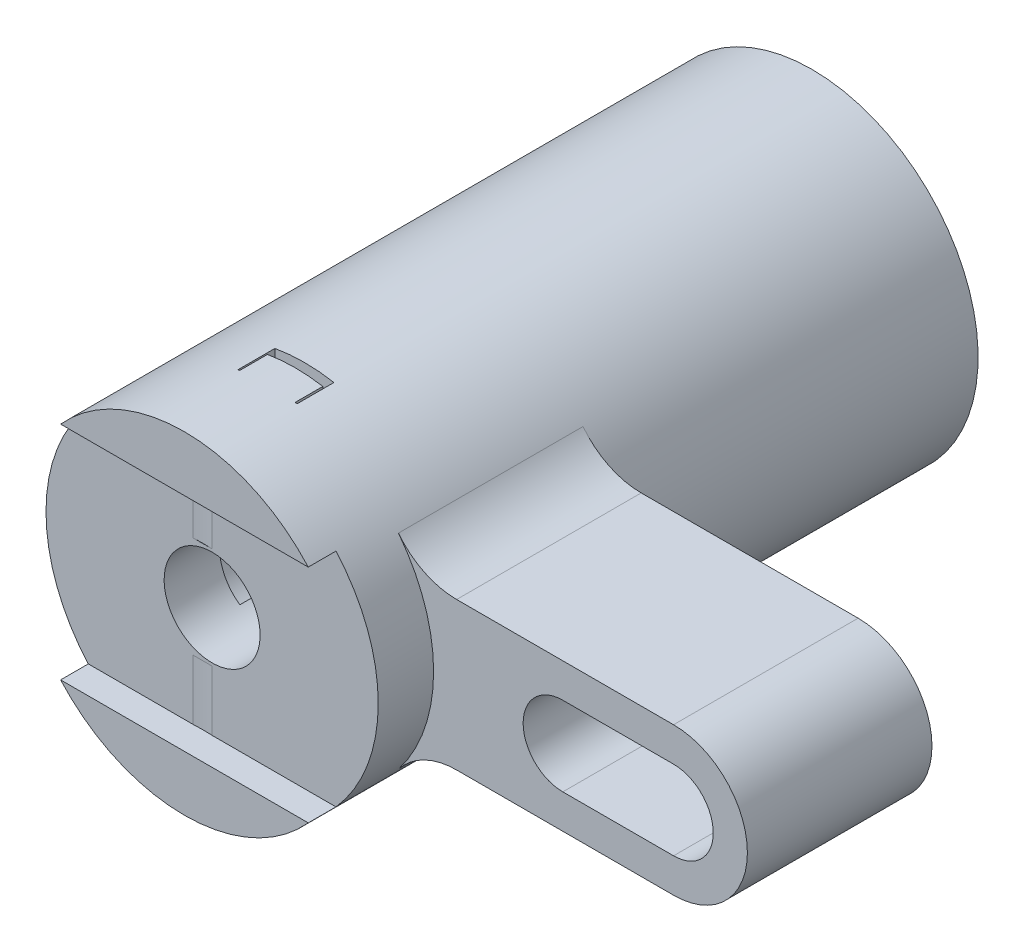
ISO-10303-21;
HEADER;
FILE_DESCRIPTION(('STEP AP214'),'2;1');
FILE_NAME('part.step','',(''),(''),'','','');
FILE_SCHEMA(('AUTOMOTIVE_DESIGN { 1 0 10303 214 1 1 1 1 }'));
ENDSEC;
DATA;
#1=APPLICATION_CONTEXT('core data for automotive mechanical design processes');
#2=APPLICATION_PROTOCOL_DEFINITION('international standard','automotive_design',2000,#1);
#3=PRODUCT_CONTEXT('',#1,'mechanical');
#4=PRODUCT('Part','Part','',(#3));
#5=PRODUCT_RELATED_PRODUCT_CATEGORY('part','',(#4));
#6=PRODUCT_DEFINITION_FORMATION('','',#4);
#7=PRODUCT_DEFINITION_CONTEXT('part definition',#1,'design');
#8=PRODUCT_DEFINITION('design','',#6,#7);
#9=PRODUCT_DEFINITION_SHAPE('','',#8);
#10=(LENGTH_UNIT() NAMED_UNIT(*) SI_UNIT(.MILLI.,.METRE.));
#11=(NAMED_UNIT(*) PLANE_ANGLE_UNIT() SI_UNIT($,.RADIAN.));
#12=(NAMED_UNIT(*) SI_UNIT($,.STERADIAN.) SOLID_ANGLE_UNIT());
#13=UNCERTAINTY_MEASURE_WITH_UNIT(LENGTH_MEASURE(1.E-05),#10,'distance_accuracy_value','');
#14=(GEOMETRIC_REPRESENTATION_CONTEXT(3) GLOBAL_UNCERTAINTY_ASSIGNED_CONTEXT((#13)) GLOBAL_UNIT_ASSIGNED_CONTEXT((#10,
#11,#12)) REPRESENTATION_CONTEXT('',''));
#15=CARTESIAN_POINT('',(0.,0.,0.));
#16=DIRECTION('',(0.,0.,1.));
#17=DIRECTION('',(1.,0.,0.));
#18=AXIS2_PLACEMENT_3D('',#15,#16,#17);
#19=CARTESIAN_POINT('',(-8.50000000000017,-2.75000000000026,91.648));
#20=DIRECTION('',(0.,-1.,0.));
#21=DIRECTION('',(-1.,0.,0.));
#22=AXIS2_PLACEMENT_3D('',#19,#20,#21);
#23=PLANE('',#22);
#24=CARTESIAN_POINT('',(0.,-2.75000000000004,49.148));
#25=CARTESIAN_POINT('',(0.98174770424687,-2.75000000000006,49.2166458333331));
#26=CARTESIAN_POINT('',(1.99074321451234,-2.75000000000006,49.0899520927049));
#27=CARTESIAN_POINT('',(3.90712600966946,-2.75000000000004,48.4447637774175));
#28=CARTESIAN_POINT('',(4.81367689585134,-2.75000000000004,47.9263241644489));
#29=CARTESIAN_POINT('',(6.37540403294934,-2.75000000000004,46.5587567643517));
#30=CARTESIAN_POINT('',(7.02981358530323,-2.75,45.7100148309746));
#31=CARTESIAN_POINT('',(7.96994804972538,-2.75,43.7990898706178));
#32=CARTESIAN_POINT('',(8.25510416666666,-2.75,42.7375763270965));
#33=CARTESIAN_POINT('',(8.39239583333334,-2.75,40.5584236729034));
#34=CARTESIAN_POINT('',(8.24426208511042,-2.75,39.4416419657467));
#35=CARTESIAN_POINT('',(7.51654531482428,-2.75,37.32601785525));
#36=CARTESIAN_POINT('',(6.93704972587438,-2.75,36.328090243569));
#37=CARTESIAN_POINT('',(5.41698962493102,-2.75,34.6138704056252));
#38=CARTESIAN_POINT('',(4.47687096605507,-2.74999999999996,33.8984048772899));
#39=CARTESIAN_POINT('',(2.36670469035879,-2.74999999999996,32.8757419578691));
#40=CARTESIAN_POINT('',(1.1974049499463,-2.74999999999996,32.5691458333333));
#41=CARTESIAN_POINT('',(-1.19740494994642,-2.74999999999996,32.4318541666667));
#42=CARTESIAN_POINT('',(-2.42197285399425,-2.74999999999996,32.6014279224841));
#43=CARTESIAN_POINT('',(-4.73683827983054,-2.75,33.4116731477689));
#44=CARTESIAN_POINT('',(-5.82614261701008,-2.74999999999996,34.0522247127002));
#45=CARTESIAN_POINT('',(-7.69285515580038,-2.74999999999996,35.7247775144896));
#46=CARTESIAN_POINT('',(-8.46937666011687,-2.75,36.7562728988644));
#47=CARTESIAN_POINT('',(-9.57456803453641,-2.75,39.0656804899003));
#48=CARTESIAN_POINT('',(-9.90260416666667,-2.75,40.3427664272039));
#49=CARTESIAN_POINT('',(-10.0398958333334,-2.75,42.9532335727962));
#50=CARTESIAN_POINT('',(-9.84888206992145,-2.75,44.2855876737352));
#51=CARTESIAN_POINT('',(-8.9561083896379,-2.75000000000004,46.7996944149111));
#52=CARTESIAN_POINT('',(-8.25450084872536,-2.75000000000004,47.9803754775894));
#53=CARTESIAN_POINT('',(-6.42945534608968,-2.75000000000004,49.9995807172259));
#54=CARTESIAN_POINT('',(-5.3065832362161,-2.75000000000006,50.8371581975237));
#55=CARTESIAN_POINT('',(-2.79793432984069,-2.75000000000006,52.024878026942));
#56=CARTESIAN_POINT('',(-1.41306219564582,-2.75000000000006,52.3743541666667));
#57=CARTESIAN_POINT('',(0.,-2.75000000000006,52.443));
#58=B_SPLINE_CURVE_WITH_KNOTS('',3,(#24,#25,#26,#27,#28,#29,#30,#31,#32,#33,#34,#35,#36,#37,#38,
#39,#40,#41,#42,#43,#44,#45,#46,#47,#48,#49,#50,#51,#52,#53,#54,#55,#56,#57),.UNSPECIFIED.,.F.,
.F.,(4,2,2,2,2,2,2,2,2,2,2,2,2,2,2,2,4),(0.,0.0625,0.125,0.1875,0.25,0.3125,0.375,0.4375,0.5,
0.5625,0.625,0.6875,0.75,0.8125,0.875,0.9375,1.),.UNSPECIFIED.);
#59=CARTESIAN_POINT('',(-1.03191115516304,-2.74999999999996,32.5));
#60=VERTEX_POINT('',#59);
#61=CARTESIAN_POINT('',(-0.00879685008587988,-2.74999999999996,32.5));
#62=VERTEX_POINT('',#61);
#63=EDGE_CURVE('E437',#60,#62,#58,.F.);
#64=ORIENTED_EDGE('',*,*,#63,.T.);
#65=DIRECTION('',(1.,0.,0.));
#66=VECTOR('',#65,1.);
#67=CARTESIAN_POINT('',(0.,-2.75000000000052,32.5));
#68=LINE('',#67,#66);
#69=EDGE_CURVE('E372',#60,#62,#68,.T.);
#70=ORIENTED_EDGE('',*,*,#69,.F.);
#71=EDGE_LOOP('',(#64,#70));
#72=FACE_BOUND('',#71,.T.);
#73=ADVANCED_FACE('F14',(#72),#23,.T.);
#74=CARTESIAN_POINT('',(0.,8.,49.148));
#75=CARTESIAN_POINT('',(0.98174770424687,8.,49.2166458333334));
#76=CARTESIAN_POINT('',(1.99074321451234,8.,49.0899520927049));
#77=CARTESIAN_POINT('',(3.9071260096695,8.,48.4447637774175));
#78=CARTESIAN_POINT('',(4.81367689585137,8.,47.9263241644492));
#79=CARTESIAN_POINT('',(6.37540403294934,8.,46.5587567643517));
#80=CARTESIAN_POINT('',(7.02981358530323,8.,45.7100148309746));
#81=CARTESIAN_POINT('',(7.9699480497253,8.,43.7990898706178));
#82=CARTESIAN_POINT('',(8.25510416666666,8.,42.7375763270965));
#83=CARTESIAN_POINT('',(8.39239583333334,8.,40.5584236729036));
#84=CARTESIAN_POINT('',(8.24426208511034,8.,39.4416419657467));
#85=CARTESIAN_POINT('',(7.51654531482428,8.,37.32601785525));
#86=CARTESIAN_POINT('',(6.93704972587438,8.,36.3280902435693));
#87=CARTESIAN_POINT('',(5.41698962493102,8.,34.6138704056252));
#88=CARTESIAN_POINT('',(4.47687096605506,8.,33.8984048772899));
#89=CARTESIAN_POINT('',(2.36670469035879,8.,32.8757419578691));
#90=CARTESIAN_POINT('',(1.19740494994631,8.,32.5691458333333));
#91=CARTESIAN_POINT('',(-1.19740494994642,8.,32.4318541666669));
#92=CARTESIAN_POINT('',(-2.42197285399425,8.,32.6014279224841));
#93=CARTESIAN_POINT('',(-4.73683827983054,8.,33.4116731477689));
#94=CARTESIAN_POINT('',(-5.82614261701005,8.,34.0522247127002));
#95=CARTESIAN_POINT('',(-7.69285515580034,8.,35.7247775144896));
#96=CARTESIAN_POINT('',(-8.46937666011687,8.,36.7562728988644));
#97=CARTESIAN_POINT('',(-9.57456803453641,8.,39.0656804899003));
#98=CARTESIAN_POINT('',(-9.90260416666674,8.,40.3427664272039));
#99=CARTESIAN_POINT('',(-10.0398958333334,8.,42.9532335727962));
#100=CARTESIAN_POINT('',(-9.84888206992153,8.,44.2855876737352));
#101=CARTESIAN_POINT('',(-8.95610838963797,8.,46.7996944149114));
#102=CARTESIAN_POINT('',(-8.25450084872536,8.,47.9803754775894));
#103=CARTESIAN_POINT('',(-6.42945534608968,8.,49.9995807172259));
#104=CARTESIAN_POINT('',(-5.3065832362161,8.,50.8371581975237));
#105=CARTESIAN_POINT('',(-2.79793432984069,8.,52.024878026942));
#106=CARTESIAN_POINT('',(-1.41306219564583,8.,52.3743541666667));
#107=CARTESIAN_POINT('',(0.,8.,52.443));
#108=B_SPLINE_CURVE_WITH_KNOTS('',3,(#74,#75,#76,#77,#78,#79,#80,#81,#82,#83,#84,#85,#86,#87,
#88,#89,#90,#91,#92,#93,#94,#95,#96,#97,#98,#99,#100,#101,#102,#103,#104,#105,#106,#107),
.UNSPECIFIED.,.F.,.F.,(4,2,2,2,2,2,2,2,2,2,2,2,2,2,2,2,4),(0.,0.0625,0.125,0.1875,0.25,0.3125,
0.375,0.4375,0.5,0.5625,0.625,0.6875,0.75,0.8125,0.875,0.9375,1.),.UNSPECIFIED.);
#109=DIRECTION('',(0.,-1.,0.));
#110=VECTOR('',#109,1.);
#111=SURFACE_OF_LINEAR_EXTRUSION('',#108,#110);
#112=ORIENTED_EDGE('',*,*,#63,.F.);
#113=DIRECTION('',(0.,-1.,0.));
#114=VECTOR('',#113,1.);
#115=CARTESIAN_POINT('',(-1.03191115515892,-4.37499999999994,32.5));
#116=LINE('',#115,#114);
#117=CARTESIAN_POINT('',(-1.03191115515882,-6.,32.5));
#118=VERTEX_POINT('',#117);
#119=EDGE_CURVE('E436',#118,#60,#116,.F.);
#120=ORIENTED_EDGE('',*,*,#119,.F.);
#121=CARTESIAN_POINT('',(0.,-6.,49.148));
#122=CARTESIAN_POINT('',(0.98174770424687,-6.,49.2166458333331));
#123=CARTESIAN_POINT('',(1.99074321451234,-6.,49.0899520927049));
#124=CARTESIAN_POINT('',(3.9071260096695,-6.,48.4447637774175));
#125=CARTESIAN_POINT('',(4.81367689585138,-6.,47.9263241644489));
#126=CARTESIAN_POINT('',(6.37540403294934,-6.,46.5587567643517));
#127=CARTESIAN_POINT('',(7.02981358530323,-6.,45.7100148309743));
#128=CARTESIAN_POINT('',(7.96994804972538,-6.,43.7990898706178));
#129=CARTESIAN_POINT('',(8.25510416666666,-6.,42.7375763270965));
#130=CARTESIAN_POINT('',(8.39239583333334,-6.,40.5584236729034));
#131=CARTESIAN_POINT('',(8.24426208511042,-6.,39.4416419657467));
#132=CARTESIAN_POINT('',(7.51654531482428,-6.,37.32601785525));
#133=CARTESIAN_POINT('',(6.93704972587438,-6.,36.328090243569));
#134=CARTESIAN_POINT('',(5.41698962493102,-6.,34.6138704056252));
#135=CARTESIAN_POINT('',(4.47687096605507,-6.,33.8984048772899));
#136=CARTESIAN_POINT('',(2.36670469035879,-6.,32.8757419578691));
#137=CARTESIAN_POINT('',(1.1974049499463,-6.,32.569145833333));
#138=CARTESIAN_POINT('',(-1.19740494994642,-5.99999999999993,32.4318541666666));
#139=CARTESIAN_POINT('',(-2.42197285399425,-6.,32.6014279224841));
#140=CARTESIAN_POINT('',(-4.73683827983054,-5.99999999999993,33.4116731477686));
#141=CARTESIAN_POINT('',(-5.82614261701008,-5.99999999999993,34.0522247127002));
#142=CARTESIAN_POINT('',(-7.69285515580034,-6.,35.7247775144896));
#143=CARTESIAN_POINT('',(-8.46937666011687,-6.,36.7562728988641));
#144=CARTESIAN_POINT('',(-9.57456803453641,-6.,39.0656804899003));
#145=CARTESIAN_POINT('',(-9.90260416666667,-6.,40.3427664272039));
#146=CARTESIAN_POINT('',(-10.0398958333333,-6.,42.9532335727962));
#147=CARTESIAN_POINT('',(-9.84888206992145,-6.,44.2855876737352));
#148=CARTESIAN_POINT('',(-8.9561083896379,-6.,46.7996944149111));
#149=CARTESIAN_POINT('',(-8.25450084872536,-6.,47.9803754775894));
#150=CARTESIAN_POINT('',(-6.42945534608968,-6.,49.9995807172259));
#151=CARTESIAN_POINT('',(-5.3065832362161,-6.,50.8371581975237));
#152=CARTESIAN_POINT('',(-2.79793432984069,-6.,52.024878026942));
#153=CARTESIAN_POINT('',(-1.41306219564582,-6.,52.3743541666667));
#154=CARTESIAN_POINT('',(0.,-6.,52.443));
#155=B_SPLINE_CURVE_WITH_KNOTS('',3,(#121,#122,#123,#124,#125,#126,#127,#128,#129,#130,#131,
#132,#133,#134,#135,#136,#137,#138,#139,#140,#141,#142,#143,#144,#145,#146,#147,#148,#149,#150,
#151,#152,#153,#154),.UNSPECIFIED.,.F.,.F.,(4,2,2,2,2,2,2,2,2,2,2,2,2,2,2,2,4),(0.,0.0625,0.125,
0.1875,0.25,0.3125,0.375,0.4375,0.5,0.5625,0.625,0.6875,0.75,0.8125,0.875,0.9375,1.),.UNSPECIFIED.);
#156=CARTESIAN_POINT('',(-0.00879685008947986,-6.,32.5));
#157=VERTEX_POINT('',#156);
#158=EDGE_CURVE('E127',#118,#157,#155,.F.);
#159=ORIENTED_EDGE('',*,*,#158,.T.);
#160=DIRECTION('',(0.,-1.,0.));
#161=VECTOR('',#160,1.);
#162=CARTESIAN_POINT('',(-0.00879685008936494,-4.375,32.5));
#163=LINE('',#162,#161);
#164=EDGE_CURVE('E439',#62,#157,#163,.T.);
#165=ORIENTED_EDGE('',*,*,#164,.F.);
#166=EDGE_LOOP('',(#112,#120,#159,#165));
#167=FACE_BOUND('',#166,.T.);
#168=ADVANCED_FACE('F461',(#167),#111,.T.);
#169=CARTESIAN_POINT('',(-8.50000000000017,2.74999999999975,91.648));
#170=DIRECTION('',(0.,1.,0.));
#171=DIRECTION('',(1.,0.,0.));
#172=AXIS2_PLACEMENT_3D('',#169,#170,#171);
#173=PLANE('',#172);
#174=CARTESIAN_POINT('',(0.,2.74999999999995,49.148));
#175=CARTESIAN_POINT('',(0.98174770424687,2.74999999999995,49.2166458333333));
#176=CARTESIAN_POINT('',(1.99074321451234,2.74999999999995,49.0899520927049));
#177=CARTESIAN_POINT('',(3.90712600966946,2.74999999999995,48.4447637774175));
#178=CARTESIAN_POINT('',(4.81367689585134,2.74999999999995,47.9263241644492));
#179=CARTESIAN_POINT('',(6.37540403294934,2.74999999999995,46.5587567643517));
#180=CARTESIAN_POINT('',(7.0298135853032,2.75,45.7100148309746));
#181=CARTESIAN_POINT('',(7.96994804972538,2.75,43.7990898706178));
#182=CARTESIAN_POINT('',(8.25510416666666,2.75,42.7375763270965));
#183=CARTESIAN_POINT('',(8.39239583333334,2.75,40.5584236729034));
#184=CARTESIAN_POINT('',(8.24426208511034,2.75,39.4416419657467));
#185=CARTESIAN_POINT('',(7.51654531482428,2.75,37.32601785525));
#186=CARTESIAN_POINT('',(6.93704972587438,2.75,36.3280902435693));
#187=CARTESIAN_POINT('',(5.41698962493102,2.75,34.6138704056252));
#188=CARTESIAN_POINT('',(4.47687096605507,2.75000000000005,33.8984048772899));
#189=CARTESIAN_POINT('',(2.36670469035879,2.75000000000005,32.8757419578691));
#190=CARTESIAN_POINT('',(1.19740494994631,2.75000000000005,32.5691458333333));
#191=CARTESIAN_POINT('',(-1.19740494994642,2.75000000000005,32.4318541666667));
#192=CARTESIAN_POINT('',(-2.42197285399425,2.75000000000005,32.6014279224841));
#193=CARTESIAN_POINT('',(-4.73683827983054,2.75,33.4116731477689));
#194=CARTESIAN_POINT('',(-5.82614261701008,2.75000000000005,34.0522247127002));
#195=CARTESIAN_POINT('',(-7.69285515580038,2.75000000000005,35.7247775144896));
#196=CARTESIAN_POINT('',(-8.46937666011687,2.75,36.7562728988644));
#197=CARTESIAN_POINT('',(-9.57456803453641,2.75,39.0656804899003));
#198=CARTESIAN_POINT('',(-9.90260416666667,2.75,40.3427664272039));
#199=CARTESIAN_POINT('',(-10.0398958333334,2.75,42.9532335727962));
#200=CARTESIAN_POINT('',(-9.84888206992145,2.75,44.2855876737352));
#201=CARTESIAN_POINT('',(-8.95610838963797,2.74999999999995,46.7996944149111));
#202=CARTESIAN_POINT('',(-8.25450084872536,2.74999999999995,47.9803754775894));
#203=CARTESIAN_POINT('',(-6.42945534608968,2.74999999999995,49.9995807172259));
#204=CARTESIAN_POINT('',(-5.30658323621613,2.74999999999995,50.8371581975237));
#205=CARTESIAN_POINT('',(-2.79793432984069,2.74999999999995,52.024878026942));
#206=CARTESIAN_POINT('',(-1.41306219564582,2.74999999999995,52.3743541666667));
#207=CARTESIAN_POINT('',(0.,2.74999999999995,52.443));
#208=B_SPLINE_CURVE_WITH_KNOTS('',3,(#174,#175,#176,#177,#178,#179,#180,#181,#182,#183,#184,
#185,#186,#187,#188,#189,#190,#191,#192,#193,#194,#195,#196,#197,#198,#199,#200,#201,#202,#203,
#204,#205,#206,#207),.UNSPECIFIED.,.F.,.F.,(4,2,2,2,2,2,2,2,2,2,2,2,2,2,2,2,4),(0.,0.0625,0.125,
0.1875,0.25,0.3125,0.375,0.4375,0.5,0.5625,0.625,0.6875,0.75,0.8125,0.875,0.9375,1.),.UNSPECIFIED.);
#209=CARTESIAN_POINT('',(-0.00879685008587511,2.75000000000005,32.5));
#210=VERTEX_POINT('',#209);
#211=CARTESIAN_POINT('',(-1.03191115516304,2.75000000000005,32.5));
#212=VERTEX_POINT('',#211);
#213=EDGE_CURVE('E433',#210,#212,#208,.T.);
#214=ORIENTED_EDGE('',*,*,#213,.T.);
#215=DIRECTION('',(-1.,0.,0.));
#216=VECTOR('',#215,1.);
#217=CARTESIAN_POINT('',(0.,2.7499999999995,32.5));
#218=LINE('',#217,#216);
#219=EDGE_CURVE('E296',#210,#212,#218,.T.);
#220=ORIENTED_EDGE('',*,*,#219,.F.);
#221=EDGE_LOOP('',(#214,#220));
#222=FACE_BOUND('',#221,.T.);
#223=ADVANCED_FACE('F432',(#222),#173,.T.);
#224=CARTESIAN_POINT('',(0.,6.,49.148));
#225=CARTESIAN_POINT('',(0.98174770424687,6.,49.2166458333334));
#226=CARTESIAN_POINT('',(1.99074321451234,6.,49.0899520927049));
#227=CARTESIAN_POINT('',(3.90712600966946,6.,48.4447637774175));
#228=CARTESIAN_POINT('',(4.81367689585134,6.,47.9263241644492));
#229=CARTESIAN_POINT('',(6.37540403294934,6.,46.5587567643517));
#230=CARTESIAN_POINT('',(7.0298135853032,6.,45.7100148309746));
#231=CARTESIAN_POINT('',(7.9699480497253,6.,43.7990898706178));
#232=CARTESIAN_POINT('',(8.25510416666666,6.,42.7375763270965));
#233=CARTESIAN_POINT('',(8.39239583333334,6.,40.5584236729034));
#234=CARTESIAN_POINT('',(8.24426208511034,6.,39.4416419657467));
#235=CARTESIAN_POINT('',(7.51654531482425,6.,37.32601785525));
#236=CARTESIAN_POINT('',(6.93704972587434,6.,36.3280902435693));
#237=CARTESIAN_POINT('',(5.41698962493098,6.,34.6138704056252));
#238=CARTESIAN_POINT('',(4.47687096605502,6.,33.8984048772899));
#239=CARTESIAN_POINT('',(2.36670469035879,6.,32.8757419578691));
#240=CARTESIAN_POINT('',(1.19740494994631,6.,32.5691458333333));
#241=CARTESIAN_POINT('',(-1.19740494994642,6.0000000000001,32.4318541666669));
#242=CARTESIAN_POINT('',(-2.42197285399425,6.,32.6014279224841));
#243=CARTESIAN_POINT('',(-4.73683827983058,6.,33.4116731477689));
#244=CARTESIAN_POINT('',(-5.82614261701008,6.,34.0522247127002));
#245=CARTESIAN_POINT('',(-7.69285515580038,6.,35.7247775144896));
#246=CARTESIAN_POINT('',(-8.46937666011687,6.,36.7562728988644));
#247=CARTESIAN_POINT('',(-9.57456803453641,6.,39.0656804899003));
#248=CARTESIAN_POINT('',(-9.90260416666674,6.,40.3427664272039));
#249=CARTESIAN_POINT('',(-10.0398958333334,6.,42.9532335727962));
#250=CARTESIAN_POINT('',(-9.84888206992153,6.,44.2855876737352));
#251=CARTESIAN_POINT('',(-8.95610838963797,6.,46.7996944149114));
#252=CARTESIAN_POINT('',(-8.25450084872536,6.,47.9803754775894));
#253=CARTESIAN_POINT('',(-6.42945534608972,6.,49.9995807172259));
#254=CARTESIAN_POINT('',(-5.30658323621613,6.,50.8371581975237));
#255=CARTESIAN_POINT('',(-2.79793432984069,6.,52.024878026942));
#256=CARTESIAN_POINT('',(-1.41306219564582,6.,52.3743541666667));
#257=CARTESIAN_POINT('',(0.,6.,52.443));
#258=B_SPLINE_CURVE_WITH_KNOTS('',3,(#224,#225,#226,#227,#228,#229,#230,#231,#232,#233,#234,
#235,#236,#237,#238,#239,#240,#241,#242,#243,#244,#245,#246,#247,#248,#249,#250,#251,#252,#253,
#254,#255,#256,#257),.UNSPECIFIED.,.F.,.F.,(4,2,2,2,2,2,2,2,2,2,2,2,2,2,2,2,4),(0.,0.0625,0.125,
0.1875,0.25,0.3125,0.375,0.4375,0.5,0.5625,0.625,0.6875,0.75,0.8125,0.875,0.9375,1.),.UNSPECIFIED.);
#259=CARTESIAN_POINT('',(-1.03191115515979,6.,32.5));
#260=VERTEX_POINT('',#259);
#261=CARTESIAN_POINT('',(-0.00879685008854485,6.,32.5));
#262=VERTEX_POINT('',#261);
#263=EDGE_CURVE('E442',#260,#262,#258,.F.);
#264=ORIENTED_EDGE('',*,*,#263,.F.);
#265=DIRECTION('',(0.,-1.,0.));
#266=VECTOR('',#265,1.);
#267=CARTESIAN_POINT('',(-1.03191115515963,4.37500000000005,32.5));
#268=LINE('',#267,#266);
#269=EDGE_CURVE('E426',#212,#260,#268,.F.);
#270=ORIENTED_EDGE('',*,*,#269,.F.);
#271=ORIENTED_EDGE('',*,*,#213,.F.);
#272=DIRECTION('',(0.,-1.,0.));
#273=VECTOR('',#272,1.);
#274=CARTESIAN_POINT('',(-0.00879685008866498,4.375,32.5));
#275=LINE('',#274,#273);
#276=EDGE_CURVE('E428',#262,#210,#275,.T.);
#277=ORIENTED_EDGE('',*,*,#276,.F.);
#278=EDGE_LOOP('',(#264,#270,#271,#277));
#279=FACE_BOUND('',#278,.T.);
#280=ADVANCED_FACE('F435',(#279),#111,.T.);
#281=CARTESIAN_POINT('',(0.,0.,28.));
#282=DIRECTION('',(0.,0.,-1.));
#283=DIRECTION('',(0.,-1.,0.));
#284=AXIS2_PLACEMENT_3D('',#281,#282,#283);
#285=PLANE('',#284);
#286=CARTESIAN_POINT('',(0.,0.,28.));
#287=DIRECTION('',(0.,0.,-1.));
#288=DIRECTION('',(0.,-1.,0.));
#289=AXIS2_PLACEMENT_3D('',#286,#287,#288);
#290=CIRCLE('',#289,2.6);
#291=CARTESIAN_POINT('',(-1.5,2.12367605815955,28.));
#292=VERTEX_POINT('',#291);
#293=CARTESIAN_POINT('',(1.5,2.12367605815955,28.));
#294=VERTEX_POINT('',#293);
#295=EDGE_CURVE('E414',#292,#294,#290,.T.);
#296=ORIENTED_EDGE('',*,*,#295,.F.);
#297=DIRECTION('',(0.,1.,0.));
#298=VECTOR('',#297,1.);
#299=CARTESIAN_POINT('',(-1.5,-8.87411967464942,28.));
#300=LINE('',#299,#298);
#301=CARTESIAN_POINT('',(-1.5,8.8741196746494,28.));
#302=VERTEX_POINT('',#301);
#303=EDGE_CURVE('E619',#292,#302,#300,.T.);
#304=ORIENTED_EDGE('',*,*,#303,.T.);
#305=CARTESIAN_POINT('',(0.,0.,28.));
#306=DIRECTION('',(0.,0.,-1.));
#307=DIRECTION('',(0.,-1.,0.));
#308=AXIS2_PLACEMENT_3D('',#305,#306,#307);
#309=CIRCLE('',#308,9.);
#310=CARTESIAN_POINT('',(1.5,8.8741196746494,28.));
#311=VERTEX_POINT('',#310);
#312=EDGE_CURVE('E329',#302,#311,#309,.T.);
#313=ORIENTED_EDGE('',*,*,#312,.T.);
#314=DIRECTION('',(0.,-1.,0.));
#315=VECTOR('',#314,1.);
#316=CARTESIAN_POINT('',(1.5,8.8741196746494,28.));
#317=LINE('',#316,#315);
#318=EDGE_CURVE('E596',#311,#294,#317,.T.);
#319=ORIENTED_EDGE('',*,*,#318,.T.);
#320=EDGE_LOOP('',(#296,#304,#313,#319));
#321=FACE_BOUND('',#320,.T.);
#322=ADVANCED_FACE('F477',(#321),#285,.T.);
#323=CARTESIAN_POINT('',(1.5,8.8741196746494,28.));
#324=DIRECTION('',(-1.,0.,0.));
#325=DIRECTION('',(0.,-1.,0.));
#326=AXIS2_PLACEMENT_3D('',#323,#324,#325);
#327=PLANE('',#326);
#328=DIRECTION('',(0.,-1.,0.));
#329=VECTOR('',#328,1.);
#330=CARTESIAN_POINT('',(1.5,8.8741196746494,29.5));
#331=LINE('',#330,#329);
#332=CARTESIAN_POINT('',(1.5,8.8741196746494,29.5));
#333=VERTEX_POINT('',#332);
#334=CARTESIAN_POINT('',(1.5,2.1236760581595,29.5));
#335=VERTEX_POINT('',#334);
#336=EDGE_CURVE('E347',#333,#335,#331,.T.);
#337=ORIENTED_EDGE('',*,*,#336,.T.);
#338=DIRECTION('',(0.,0.,1.));
#339=VECTOR('',#338,1.);
#340=CARTESIAN_POINT('',(1.5,2.12367605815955,32.5));
#341=LINE('',#340,#339);
#342=EDGE_CURVE('E608',#335,#294,#341,.F.);
#343=ORIENTED_EDGE('',*,*,#342,.T.);
#344=ORIENTED_EDGE('',*,*,#318,.F.);
#345=DIRECTION('',(0.,0.,1.));
#346=VECTOR('',#345,1.);
#347=CARTESIAN_POINT('',(1.5,8.8741196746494,28.));
#348=LINE('',#347,#346);
#349=EDGE_CURVE('E333',#311,#333,#348,.T.);
#350=ORIENTED_EDGE('',*,*,#349,.T.);
#351=EDGE_LOOP('',(#337,#343,#344,#350));
#352=FACE_BOUND('',#351,.T.);
#353=ADVANCED_FACE('F478',(#352),#327,.F.);
#354=CARTESIAN_POINT('',(0.,0.,29.5));
#355=DIRECTION('',(0.,0.,-1.));
#356=DIRECTION('',(0.,-1.,0.));
#357=AXIS2_PLACEMENT_3D('',#354,#355,#356);
#358=PLANE('',#357);
#359=CARTESIAN_POINT('',(0.,0.,29.5));
#360=DIRECTION('',(0.,0.,-1.));
#361=DIRECTION('',(0.,-1.,0.));
#362=AXIS2_PLACEMENT_3D('',#359,#360,#361);
#363=CIRCLE('',#362,9.);
#364=CARTESIAN_POINT('',(1.6,8.8566359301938,29.5));
#365=VERTEX_POINT('',#364);
#366=EDGE_CURVE('E274',#333,#365,#363,.T.);
#367=ORIENTED_EDGE('',*,*,#366,.T.);
#368=DIRECTION('',(0.,-1.,0.));
#369=VECTOR('',#368,1.);
#370=CARTESIAN_POINT('',(1.6,0.,29.5));
#371=LINE('',#370,#369);
#372=CARTESIAN_POINT('',(1.6,2.2366269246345,29.5));
#373=VERTEX_POINT('',#372);
#374=EDGE_CURVE('E9',#365,#373,#371,.T.);
#375=ORIENTED_EDGE('',*,*,#374,.T.);
#376=CARTESIAN_POINT('',(0.,0.,29.5));
#377=DIRECTION('',(0.,0.,-1.));
#378=DIRECTION('',(-1.,0.,0.));
#379=AXIS2_PLACEMENT_3D('',#376,#377,#378);
#380=CIRCLE('',#379,2.75);
#381=CARTESIAN_POINT('',(1.6,-2.2366269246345,29.5));
#382=VERTEX_POINT('',#381);
#383=EDGE_CURVE('E24',#382,#373,#380,.F.);
#384=ORIENTED_EDGE('',*,*,#383,.F.);
#385=DIRECTION('',(0.,-1.,0.));
#386=VECTOR('',#385,1.);
#387=CARTESIAN_POINT('',(1.6,0.,29.5));
#388=LINE('',#387,#386);
#389=CARTESIAN_POINT('',(1.6,-8.85663593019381,29.5));
#390=VERTEX_POINT('',#389);
#391=EDGE_CURVE('E243',#382,#390,#388,.T.);
#392=ORIENTED_EDGE('',*,*,#391,.T.);
#393=CARTESIAN_POINT('',(1.5,-8.87411967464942,29.5));
#394=VERTEX_POINT('',#393);
#395=EDGE_CURVE('E249',#390,#394,#363,.T.);
#396=ORIENTED_EDGE('',*,*,#395,.T.);
#397=CARTESIAN_POINT('',(1.5,-2.12367605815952,29.5));
#398=VERTEX_POINT('',#397);
#399=EDGE_CURVE('E352',#398,#394,#331,.T.);
#400=ORIENTED_EDGE('',*,*,#399,.F.);
#401=CARTESIAN_POINT('',(0.,0.,29.5));
#402=DIRECTION('',(0.,0.,-1.));
#403=DIRECTION('',(0.,-1.,0.));
#404=AXIS2_PLACEMENT_3D('',#401,#402,#403);
#405=CIRCLE('',#404,2.6);
#406=EDGE_CURVE('E610',#335,#398,#405,.T.);
#407=ORIENTED_EDGE('',*,*,#406,.F.);
#408=ORIENTED_EDGE('',*,*,#336,.F.);
#409=EDGE_LOOP('',(#367,#375,#384,#392,#396,#400,#407,#408));
#410=FACE_BOUND('',#409,.T.);
#411=ADVANCED_FACE('F246',(#410),#358,.T.);
#412=CARTESIAN_POINT('',(1.5,-2.12367605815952,28.));
#413=VERTEX_POINT('',#412);
#414=CARTESIAN_POINT('',(1.5,-8.87411967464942,28.));
#415=VERTEX_POINT('',#414);
#416=EDGE_CURVE('E768',#413,#415,#317,.T.);
#417=ORIENTED_EDGE('',*,*,#416,.F.);
#418=DIRECTION('',(0.,0.,1.));
#419=VECTOR('',#418,1.);
#420=CARTESIAN_POINT('',(1.5,-2.12367605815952,32.5));
#421=LINE('',#420,#419);
#422=EDGE_CURVE('E612',#413,#398,#421,.T.);
#423=ORIENTED_EDGE('',*,*,#422,.T.);
#424=ORIENTED_EDGE('',*,*,#399,.T.);
#425=DIRECTION('',(0.,0.,1.));
#426=VECTOR('',#425,1.);
#427=CARTESIAN_POINT('',(1.5,-8.87411967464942,28.));
#428=LINE('',#427,#426);
#429=EDGE_CURVE('E270',#415,#394,#428,.T.);
#430=ORIENTED_EDGE('',*,*,#429,.F.);
#431=EDGE_LOOP('',(#417,#423,#424,#430));
#432=FACE_BOUND('',#431,.T.);
#433=ADVANCED_FACE('F475',(#432),#327,.F.);
#434=CARTESIAN_POINT('',(-1.5,-2.12367605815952,28.));
#435=VERTEX_POINT('',#434);
#436=EDGE_CURVE('E363',#413,#435,#290,.T.);
#437=ORIENTED_EDGE('',*,*,#436,.F.);
#438=ORIENTED_EDGE('',*,*,#416,.T.);
#439=CARTESIAN_POINT('',(0.,0.,28.));
#440=DIRECTION('',(0.,0.,-1.));
#441=DIRECTION('',(0.,-1.,0.));
#442=AXIS2_PLACEMENT_3D('',#439,#440,#441);
#443=CIRCLE('',#442,9.);
#444=CARTESIAN_POINT('',(-1.5,-8.87411967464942,28.));
#445=VERTEX_POINT('',#444);
#446=EDGE_CURVE('E351',#415,#445,#443,.T.);
#447=ORIENTED_EDGE('',*,*,#446,.T.);
#448=EDGE_CURVE('E626',#445,#435,#300,.T.);
#449=ORIENTED_EDGE('',*,*,#448,.T.);
#450=EDGE_LOOP('',(#437,#438,#447,#449));
#451=FACE_BOUND('',#450,.T.);
#452=ADVANCED_FACE('F472',(#451),#285,.T.);
#453=CARTESIAN_POINT('',(0.,0.,34.));
#454=DIRECTION('',(0.,0.,-1.));
#455=DIRECTION('',(0.,-1.,0.));
#456=AXIS2_PLACEMENT_3D('',#453,#454,#455);
#457=PLANE('',#456);
#458=CARTESIAN_POINT('',(0.,0.,34.));
#459=DIRECTION('',(0.,0.,1.));
#460=DIRECTION('',(0.,-1.,0.));
#461=AXIS2_PLACEMENT_3D('',#458,#459,#460);
#462=CIRCLE('',#461,9.);
#463=CARTESIAN_POINT('',(6.70820393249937,6.,34.));
#464=VERTEX_POINT('',#463);
#465=CARTESIAN_POINT('',(-6.70820393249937,6.,34.));
#466=VERTEX_POINT('',#465);
#467=EDGE_CURVE('E377',#464,#466,#462,.T.);
#468=ORIENTED_EDGE('',*,*,#467,.T.);
#469=DIRECTION('',(1.,0.,0.));
#470=VECTOR('',#469,1.);
#471=CARTESIAN_POINT('',(6.70820393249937,6.,34.));
#472=LINE('',#471,#470);
#473=EDGE_CURVE('E388',#466,#464,#472,.T.);
#474=ORIENTED_EDGE('',*,*,#473,.T.);
#475=EDGE_LOOP('',(#468,#474));
#476=FACE_BOUND('',#475,.T.);
#477=ADVANCED_FACE('F400',(#476),#457,.F.);
#478=CARTESIAN_POINT('',(6.70820393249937,6.,34.));
#479=DIRECTION('',(0.,1.,0.));
#480=DIRECTION('',(-1.,0.,0.));
#481=AXIS2_PLACEMENT_3D('',#478,#479,#480);
#482=PLANE('',#481);
#483=DIRECTION('',(0.,0.,-1.));
#484=VECTOR('',#483,1.);
#485=CARTESIAN_POINT('',(6.70820393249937,6.,34.));
#486=LINE('',#485,#484);
#487=CARTESIAN_POINT('',(6.70820393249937,6.,32.5));
#488=VERTEX_POINT('',#487);
#489=EDGE_CURVE('E277',#464,#488,#486,.T.);
#490=ORIENTED_EDGE('',*,*,#489,.F.);
#491=ORIENTED_EDGE('',*,*,#473,.F.);
#492=DIRECTION('',(0.,0.,-1.));
#493=VECTOR('',#492,1.);
#494=CARTESIAN_POINT('',(-6.70820393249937,6.,34.));
#495=LINE('',#494,#493);
#496=CARTESIAN_POINT('',(-6.70820393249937,6.,32.5));
#497=VERTEX_POINT('',#496);
#498=EDGE_CURVE('E272',#466,#497,#495,.T.);
#499=ORIENTED_EDGE('',*,*,#498,.T.);
#500=DIRECTION('',(1.,0.,0.));
#501=VECTOR('',#500,1.);
#502=CARTESIAN_POINT('',(6.70820393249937,6.,32.5));
#503=LINE('',#502,#501);
#504=EDGE_CURVE('E370',#497,#260,#503,.T.);
#505=ORIENTED_EDGE('',*,*,#504,.T.);
#506=ORIENTED_EDGE('',*,*,#263,.T.);
#507=EDGE_CURVE('E368',#262,#488,#503,.T.);
#508=ORIENTED_EDGE('',*,*,#507,.T.);
#509=EDGE_LOOP('',(#490,#491,#499,#505,#506,#508));
#510=FACE_BOUND('',#509,.T.);
#511=ADVANCED_FACE('F407',(#510),#482,.F.);
#512=CARTESIAN_POINT('',(0.,0.,34.));
#513=DIRECTION('',(0.,0.,1.));
#514=DIRECTION('',(0.,1.,0.));
#515=AXIS2_PLACEMENT_3D('',#512,#513,#514);
#516=PLANE('',#515);
#517=CARTESIAN_POINT('',(0.,0.,34.));
#518=DIRECTION('',(0.,0.,1.));
#519=DIRECTION('',(0.,1.,0.));
#520=AXIS2_PLACEMENT_3D('',#517,#518,#519);
#521=CIRCLE('',#520,9.);
#522=CARTESIAN_POINT('',(-6.70820393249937,-6.,34.));
#523=VERTEX_POINT('',#522);
#524=CARTESIAN_POINT('',(6.70820393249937,-6.,34.));
#525=VERTEX_POINT('',#524);
#526=EDGE_CURVE('E593',#523,#525,#521,.T.);
#527=ORIENTED_EDGE('',*,*,#526,.T.);
#528=DIRECTION('',(-1.,0.,0.));
#529=VECTOR('',#528,1.);
#530=CARTESIAN_POINT('',(6.70820393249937,-6.,34.));
#531=LINE('',#530,#529);
#532=EDGE_CURVE('E600',#525,#523,#531,.T.);
#533=ORIENTED_EDGE('',*,*,#532,.T.);
#534=EDGE_LOOP('',(#527,#533));
#535=FACE_BOUND('',#534,.T.);
#536=ADVANCED_FACE('F485',(#535),#516,.T.);
#537=CARTESIAN_POINT('',(6.70820393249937,-6.,34.));
#538=DIRECTION('',(0.,-1.,0.));
#539=DIRECTION('',(1.,0.,0.));
#540=AXIS2_PLACEMENT_3D('',#537,#538,#539);
#541=PLANE('',#540);
#542=DIRECTION('',(0.,0.,-1.));
#543=VECTOR('',#542,1.);
#544=CARTESIAN_POINT('',(-6.70820393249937,-6.,34.));
#545=LINE('',#544,#543);
#546=CARTESIAN_POINT('',(-6.70820393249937,-6.,32.5));
#547=VERTEX_POINT('',#546);
#548=EDGE_CURVE('E601',#523,#547,#545,.T.);
#549=ORIENTED_EDGE('',*,*,#548,.F.);
#550=ORIENTED_EDGE('',*,*,#532,.F.);
#551=DIRECTION('',(0.,0.,-1.));
#552=VECTOR('',#551,1.);
#553=CARTESIAN_POINT('',(6.70820393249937,-6.,34.));
#554=LINE('',#553,#552);
#555=CARTESIAN_POINT('',(6.70820393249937,-6.,32.5));
#556=VERTEX_POINT('',#555);
#557=EDGE_CURVE('E371',#525,#556,#554,.T.);
#558=ORIENTED_EDGE('',*,*,#557,.T.);
#559=DIRECTION('',(-1.,0.,0.));
#560=VECTOR('',#559,1.);
#561=CARTESIAN_POINT('',(6.70820393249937,-6.,32.5));
#562=LINE('',#561,#560);
#563=EDGE_CURVE('E590',#556,#157,#562,.T.);
#564=ORIENTED_EDGE('',*,*,#563,.T.);
#565=ORIENTED_EDGE('',*,*,#158,.F.);
#566=EDGE_CURVE('E336',#118,#547,#562,.T.);
#567=ORIENTED_EDGE('',*,*,#566,.T.);
#568=EDGE_LOOP('',(#549,#550,#558,#564,#565,#567));
#569=FACE_BOUND('',#568,.T.);
#570=ADVANCED_FACE('F488',(#569),#541,.F.);
#571=CARTESIAN_POINT('',(0.,0.,32.5));
#572=DIRECTION('',(0.,0.,1.));
#573=DIRECTION('',(0.,1.,0.));
#574=AXIS2_PLACEMENT_3D('',#571,#572,#573);
#575=PLANE('',#574);
#576=CARTESIAN_POINT('',(0.,0.,32.5));
#577=DIRECTION('',(0.,0.,1.));
#578=DIRECTION('',(0.,1.,0.));
#579=AXIS2_PLACEMENT_3D('',#576,#577,#578);
#580=CIRCLE('',#579,2.6);
#581=CARTESIAN_POINT('',(0.,2.6,32.5));
#582=VERTEX_POINT('',#581);
#583=EDGE_CURVE('E605',#582,#582,#580,.T.);
#584=ORIENTED_EDGE('',*,*,#583,.F.);
#585=EDGE_LOOP('',(#584));
#586=FACE_BOUND('',#585,.T.);
#587=ORIENTED_EDGE('',*,*,#507,.F.);
#588=ORIENTED_EDGE('',*,*,#276,.T.);
#589=ORIENTED_EDGE('',*,*,#219,.T.);
#590=ORIENTED_EDGE('',*,*,#269,.T.);
#591=ORIENTED_EDGE('',*,*,#504,.F.);
#592=CARTESIAN_POINT('',(0.,0.,32.5));
#593=DIRECTION('',(0.,0.,-1.));
#594=DIRECTION('',(0.,-1.,0.));
#595=AXIS2_PLACEMENT_3D('',#592,#593,#594);
#596=CIRCLE('',#595,9.);
#597=EDGE_CURVE('E392',#547,#497,#596,.T.);
#598=ORIENTED_EDGE('',*,*,#597,.F.);
#599=ORIENTED_EDGE('',*,*,#566,.F.);
#600=ORIENTED_EDGE('',*,*,#119,.T.);
#601=ORIENTED_EDGE('',*,*,#69,.T.);
#602=ORIENTED_EDGE('',*,*,#164,.T.);
#603=ORIENTED_EDGE('',*,*,#563,.F.);
#604=EDGE_CURVE('E384',#488,#556,#596,.T.);
#605=ORIENTED_EDGE('',*,*,#604,.F.);
#606=EDGE_LOOP('',(#587,#588,#589,#590,#591,#598,#599,#600,#601,#602,#603,#605));
#607=FACE_BOUND('',#606,.T.);
#608=ADVANCED_FACE('F425',(#586,#607),#575,.T.);
#609=CARTESIAN_POINT('',(-1.5,-8.87411967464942,28.));
#610=DIRECTION('',(1.,0.,0.));
#611=DIRECTION('',(0.,1.,0.));
#612=AXIS2_PLACEMENT_3D('',#609,#610,#611);
#613=PLANE('',#612);
#614=DIRECTION('',(0.,1.,0.));
#615=VECTOR('',#614,1.);
#616=CARTESIAN_POINT('',(-1.5,-8.87411967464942,29.5));
#617=LINE('',#616,#615);
#618=CARTESIAN_POINT('',(-1.5,-8.87411967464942,29.5));
#619=VERTEX_POINT('',#618);
#620=CARTESIAN_POINT('',(-1.5,-2.12367605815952,29.5));
#621=VERTEX_POINT('',#620);
#622=EDGE_CURVE('E341',#619,#621,#617,.T.);
#623=ORIENTED_EDGE('',*,*,#622,.T.);
#624=DIRECTION('',(0.,0.,1.));
#625=VECTOR('',#624,1.);
#626=CARTESIAN_POINT('',(-1.5,-2.12367605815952,32.5));
#627=LINE('',#626,#625);
#628=EDGE_CURVE('E615',#621,#435,#627,.F.);
#629=ORIENTED_EDGE('',*,*,#628,.T.);
#630=ORIENTED_EDGE('',*,*,#448,.F.);
#631=DIRECTION('',(0.,0.,1.));
#632=VECTOR('',#631,1.);
#633=CARTESIAN_POINT('',(-1.5,-8.87411967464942,28.));
#634=LINE('',#633,#632);
#635=EDGE_CURVE('E332',#445,#619,#634,.T.);
#636=ORIENTED_EDGE('',*,*,#635,.T.);
#637=EDGE_LOOP('',(#623,#629,#630,#636));
#638=FACE_BOUND('',#637,.T.);
#639=ADVANCED_FACE('F470',(#638),#613,.F.);
#640=CARTESIAN_POINT('',(0.,0.,32.5));
#641=DIRECTION('',(0.,0.,1.));
#642=DIRECTION('',(0.,1.,0.));
#643=AXIS2_PLACEMENT_3D('',#640,#641,#642);
#644=CYLINDRICAL_SURFACE('',#643,2.6);
#645=ORIENTED_EDGE('',*,*,#583,.T.);
#646=EDGE_LOOP('',(#645));
#647=FACE_BOUND('',#646,.T.);
#648=ORIENTED_EDGE('',*,*,#295,.T.);
#649=ORIENTED_EDGE('',*,*,#342,.F.);
#650=ORIENTED_EDGE('',*,*,#406,.T.);
#651=ORIENTED_EDGE('',*,*,#422,.F.);
#652=ORIENTED_EDGE('',*,*,#436,.T.);
#653=ORIENTED_EDGE('',*,*,#628,.F.);
#654=CARTESIAN_POINT('',(0.,0.,29.5));
#655=DIRECTION('',(0.,0.,-1.));
#656=DIRECTION('',(0.,-1.,0.));
#657=AXIS2_PLACEMENT_3D('',#654,#655,#656);
#658=CIRCLE('',#657,2.6);
#659=CARTESIAN_POINT('',(-1.5,2.12367605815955,29.5));
#660=VERTEX_POINT('',#659);
#661=EDGE_CURVE('E617',#621,#660,#658,.T.);
#662=ORIENTED_EDGE('',*,*,#661,.T.);
#663=DIRECTION('',(0.,0.,1.));
#664=VECTOR('',#663,1.);
#665=CARTESIAN_POINT('',(-1.5,2.12367605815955,32.5));
#666=LINE('',#665,#664);
#667=EDGE_CURVE('E367',#292,#660,#666,.T.);
#668=ORIENTED_EDGE('',*,*,#667,.F.);
#669=EDGE_LOOP('',(#648,#649,#650,#651,#652,#653,#662,#668));
#670=FACE_BOUND('',#669,.T.);
#671=ADVANCED_FACE('F466',(#647,#670),#644,.F.);
#672=ORIENTED_EDGE('',*,*,#303,.F.);
#673=ORIENTED_EDGE('',*,*,#667,.T.);
#674=CARTESIAN_POINT('',(-1.5,8.8741196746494,29.5));
#675=VERTEX_POINT('',#674);
#676=EDGE_CURVE('E365',#660,#675,#617,.T.);
#677=ORIENTED_EDGE('',*,*,#676,.T.);
#678=DIRECTION('',(0.,0.,1.));
#679=VECTOR('',#678,1.);
#680=CARTESIAN_POINT('',(-1.5,8.8741196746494,28.));
#681=LINE('',#680,#679);
#682=EDGE_CURVE('E327',#302,#675,#681,.T.);
#683=ORIENTED_EDGE('',*,*,#682,.F.);
#684=EDGE_LOOP('',(#672,#673,#677,#683));
#685=FACE_BOUND('',#684,.T.);
#686=ADVANCED_FACE('F469',(#685),#613,.F.);
#687=CARTESIAN_POINT('',(0.,0.,29.5));
#688=DIRECTION('',(0.,0.,-1.));
#689=DIRECTION('',(0.,-1.,0.));
#690=AXIS2_PLACEMENT_3D('',#687,#688,#689);
#691=CYLINDRICAL_SURFACE('',#690,9.);
#692=ORIENTED_EDGE('',*,*,#395,.F.);
#693=DIRECTION('',(0.,0.,-1.));
#694=VECTOR('',#693,1.);
#695=CARTESIAN_POINT('',(1.6,-8.85663593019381,29.5));
#696=LINE('',#695,#694);
#697=CARTESIAN_POINT('',(1.6,-8.85663593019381,27.5));
#698=VERTEX_POINT('',#697);
#699=EDGE_CURVE('E256',#390,#698,#696,.T.);
#700=ORIENTED_EDGE('',*,*,#699,.T.);
#701=CARTESIAN_POINT('',(0.,0.,27.5));
#702=DIRECTION('',(0.,0.,1.));
#703=DIRECTION('',(0.,1.,0.));
#704=AXIS2_PLACEMENT_3D('',#701,#702,#703);
#705=CIRCLE('',#704,9.);
#706=CARTESIAN_POINT('',(-1.6,-8.85663593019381,27.5));
#707=VERTEX_POINT('',#706);
#708=EDGE_CURVE('E758',#707,#698,#705,.T.);
#709=ORIENTED_EDGE('',*,*,#708,.F.);
#710=DIRECTION('',(0.,0.,-1.));
#711=VECTOR('',#710,1.);
#712=CARTESIAN_POINT('',(-1.6,-8.85663593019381,29.5));
#713=LINE('',#712,#711);
#714=CARTESIAN_POINT('',(-1.6,-8.85663593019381,29.5));
#715=VERTEX_POINT('',#714);
#716=EDGE_CURVE('E263',#707,#715,#713,.F.);
#717=ORIENTED_EDGE('',*,*,#716,.T.);
#718=EDGE_CURVE('E285',#619,#715,#363,.T.);
#719=ORIENTED_EDGE('',*,*,#718,.F.);
#720=ORIENTED_EDGE('',*,*,#635,.F.);
#721=ORIENTED_EDGE('',*,*,#446,.F.);
#722=ORIENTED_EDGE('',*,*,#429,.T.);
#723=EDGE_LOOP('',(#692,#700,#709,#717,#719,#720,#721,#722));
#724=FACE_BOUND('',#723,.T.);
#725=CARTESIAN_POINT('',(7.09404283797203,5.53846153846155,29.5));
#726=VERTEX_POINT('',#725);
#727=CARTESIAN_POINT('',(7.09404283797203,-5.53846153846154,29.5));
#728=VERTEX_POINT('',#727);
#729=EDGE_CURVE('E271',#726,#728,#363,.T.);
#730=ORIENTED_EDGE('',*,*,#729,.F.);
#731=DIRECTION('',(0.,0.,-1.));
#732=VECTOR('',#731,1.);
#733=CARTESIAN_POINT('',(7.09404283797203,5.53846153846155,29.5));
#734=LINE('',#733,#732);
#735=CARTESIAN_POINT('',(7.09404283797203,5.53846153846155,19.5));
#736=VERTEX_POINT('',#735);
#737=EDGE_CURVE('E707',#726,#736,#734,.T.);
#738=ORIENTED_EDGE('',*,*,#737,.T.);
#739=CARTESIAN_POINT('',(0.,0.,19.5));
#740=DIRECTION('',(0.,0.,1.));
#741=DIRECTION('',(0.,1.,0.));
#742=AXIS2_PLACEMENT_3D('',#739,#740,#741);
#743=CIRCLE('',#742,9.);
#744=CARTESIAN_POINT('',(7.09404283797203,-5.53846153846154,19.5));
#745=VERTEX_POINT('',#744);
#746=EDGE_CURVE('E683',#745,#736,#743,.T.);
#747=ORIENTED_EDGE('',*,*,#746,.F.);
#748=DIRECTION('',(0.,0.,-1.));
#749=VECTOR('',#748,1.);
#750=CARTESIAN_POINT('',(7.09404283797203,-5.53846153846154,29.5));
#751=LINE('',#750,#749);
#752=EDGE_CURVE('E710',#745,#728,#751,.F.);
#753=ORIENTED_EDGE('',*,*,#752,.T.);
#754=EDGE_LOOP('',(#730,#738,#747,#753));
#755=FACE_BOUND('',#754,.T.);
#756=ORIENTED_EDGE('',*,*,#604,.T.);
#757=ORIENTED_EDGE('',*,*,#557,.F.);
#758=ORIENTED_EDGE('',*,*,#526,.F.);
#759=ORIENTED_EDGE('',*,*,#548,.T.);
#760=ORIENTED_EDGE('',*,*,#597,.T.);
#761=ORIENTED_EDGE('',*,*,#498,.F.);
#762=ORIENTED_EDGE('',*,*,#467,.F.);
#763=ORIENTED_EDGE('',*,*,#489,.T.);
#764=EDGE_LOOP('',(#756,#757,#758,#759,#760,#761,#762,#763));
#765=FACE_BOUND('',#764,.T.);
#766=DIRECTION('',(0.,0.,-1.));
#767=VECTOR('',#766,1.);
#768=CARTESIAN_POINT('',(1.6,8.8566359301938,29.5));
#769=LINE('',#768,#767);
#770=CARTESIAN_POINT('',(1.6,8.8566359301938,27.5));
#771=VERTEX_POINT('',#770);
#772=EDGE_CURVE('E319',#771,#365,#769,.F.);
#773=ORIENTED_EDGE('',*,*,#772,.T.);
#774=ORIENTED_EDGE('',*,*,#366,.F.);
#775=ORIENTED_EDGE('',*,*,#349,.F.);
#776=ORIENTED_EDGE('',*,*,#312,.F.);
#777=ORIENTED_EDGE('',*,*,#682,.T.);
#778=CARTESIAN_POINT('',(-1.6,8.8566359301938,29.5));
#779=VERTEX_POINT('',#778);
#780=EDGE_CURVE('E293',#779,#675,#363,.T.);
#781=ORIENTED_EDGE('',*,*,#780,.F.);
#782=DIRECTION('',(0.,0.,-1.));
#783=VECTOR('',#782,1.);
#784=CARTESIAN_POINT('',(-1.6,8.8566359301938,29.5));
#785=LINE('',#784,#783);
#786=CARTESIAN_POINT('',(-1.6,8.8566359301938,27.5));
#787=VERTEX_POINT('',#786);
#788=EDGE_CURVE('E313',#779,#787,#785,.T.);
#789=ORIENTED_EDGE('',*,*,#788,.T.);
#790=EDGE_CURVE('E320',#771,#787,#705,.T.);
#791=ORIENTED_EDGE('',*,*,#790,.F.);
#792=EDGE_LOOP('',(#773,#774,#775,#776,#777,#781,#789,#791));
#793=FACE_BOUND('',#792,.T.);
#794=CARTESIAN_POINT('',(0.,0.,0.));
#795=DIRECTION('',(0.,0.,1.));
#796=DIRECTION('',(0.,1.,0.));
#797=AXIS2_PLACEMENT_3D('',#794,#795,#796);
#798=CIRCLE('',#797,9.);
#799=CARTESIAN_POINT('',(0.,9.,0.));
#800=VERTEX_POINT('',#799);
#801=EDGE_CURVE('E684',#800,#800,#798,.T.);
#802=ORIENTED_EDGE('',*,*,#801,.T.);
#803=EDGE_LOOP('',(#802));
#804=FACE_BOUND('',#803,.T.);
#805=ADVANCED_FACE('F266',(#724,#755,#765,#793,#804),#691,.T.);
#806=CARTESIAN_POINT('',(0.,0.,29.5));
#807=DIRECTION('',(0.,0.,-1.));
#808=DIRECTION('',(-1.,0.,0.));
#809=AXIS2_PLACEMENT_3D('',#806,#807,#808);
#810=CIRCLE('',#809,2.75);
#811=CARTESIAN_POINT('',(-1.6,2.2366269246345,29.5));
#812=VERTEX_POINT('',#811);
#813=CARTESIAN_POINT('',(-1.6,-2.2366269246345,29.5));
#814=VERTEX_POINT('',#813);
#815=EDGE_CURVE('E300',#812,#814,#810,.F.);
#816=ORIENTED_EDGE('',*,*,#815,.F.);
#817=DIRECTION('',(0.,1.,0.));
#818=VECTOR('',#817,1.);
#819=CARTESIAN_POINT('',(-1.6,0.,29.5));
#820=LINE('',#819,#818);
#821=EDGE_CURVE('E252',#812,#779,#820,.T.);
#822=ORIENTED_EDGE('',*,*,#821,.T.);
#823=ORIENTED_EDGE('',*,*,#780,.T.);
#824=ORIENTED_EDGE('',*,*,#676,.F.);
#825=ORIENTED_EDGE('',*,*,#661,.F.);
#826=ORIENTED_EDGE('',*,*,#622,.F.);
#827=ORIENTED_EDGE('',*,*,#718,.T.);
#828=DIRECTION('',(0.,1.,0.));
#829=VECTOR('',#828,1.);
#830=CARTESIAN_POINT('',(-1.6,0.,29.5));
#831=LINE('',#830,#829);
#832=EDGE_CURVE('E298',#715,#814,#831,.T.);
#833=ORIENTED_EDGE('',*,*,#832,.T.);
#834=EDGE_LOOP('',(#816,#822,#823,#824,#825,#826,#827,#833));
#835=FACE_BOUND('',#834,.T.);
#836=ADVANCED_FACE('F305',(#835),#358,.T.);
#837=CARTESIAN_POINT('',(-6.,0.,18.));
#838=DIRECTION('',(0.,0.,1.));
#839=DIRECTION('',(0.,1.,0.));
#840=AXIS2_PLACEMENT_3D('',#837,#838,#839);
#841=PLANE('',#840);
#842=CARTESIAN_POINT('',(0.,0.,18.));
#843=DIRECTION('',(0.,0.,1.));
#844=DIRECTION('',(0.,1.,0.));
#845=AXIS2_PLACEMENT_3D('',#842,#843,#844);
#846=CIRCLE('',#845,2.5);
#847=CARTESIAN_POINT('',(0.,2.5,18.));
#848=VERTEX_POINT('',#847);
#849=EDGE_CURVE('E1043',#848,#848,#846,.T.);
#850=ORIENTED_EDGE('',*,*,#849,.T.);
#851=EDGE_LOOP('',(#850));
#852=FACE_BOUND('',#851,.T.);
#853=CARTESIAN_POINT('',(0.,0.,18.));
#854=DIRECTION('',(0.,0.,-1.));
#855=DIRECTION('',(0.,-1.,0.));
#856=AXIS2_PLACEMENT_3D('',#853,#854,#855);
#857=CIRCLE('',#856,6.);
#858=CARTESIAN_POINT('',(0.,-6.,18.));
#859=VERTEX_POINT('',#858);
#860=EDGE_CURVE('E1037',#859,#859,#857,.T.);
#861=ORIENTED_EDGE('',*,*,#860,.T.);
#862=EDGE_LOOP('',(#861));
#863=FACE_BOUND('',#862,.T.);
#864=ADVANCED_FACE('F508',(#852,#863),#841,.F.);
#865=CARTESIAN_POINT('',(0.,0.,31.5));
#866=DIRECTION('',(0.,0.,-1.));
#867=DIRECTION('',(-0.5,0.866025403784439,0.));
#868=AXIS2_PLACEMENT_3D('',#865,#866,#867);
#869=CYLINDRICAL_SURFACE('',#868,2.5);
#870=ORIENTED_EDGE('',*,*,#849,.F.);
#871=EDGE_LOOP('',(#870));
#872=FACE_BOUND('',#871,.T.);
#873=CARTESIAN_POINT('',(0.,0.,19.5));
#874=DIRECTION('',(0.,0.,-1.));
#875=DIRECTION('',(0.,-1.,0.));
#876=AXIS2_PLACEMENT_3D('',#873,#874,#875);
#877=CIRCLE('',#876,2.5);
#878=CARTESIAN_POINT('',(0.,-2.5,19.5));
#879=VERTEX_POINT('',#878);
#880=EDGE_CURVE('E1040',#879,#879,#877,.T.);
#881=ORIENTED_EDGE('',*,*,#880,.F.);
#882=EDGE_LOOP('',(#881));
#883=FACE_BOUND('',#882,.T.);
#884=ADVANCED_FACE('F504',(#872,#883),#869,.F.);
#885=CARTESIAN_POINT('',(0.,0.,-10.5));
#886=DIRECTION('',(0.,0.,-1.));
#887=DIRECTION('',(0.,-1.,0.));
#888=AXIS2_PLACEMENT_3D('',#885,#886,#887);
#889=CYLINDRICAL_SURFACE('',#888,6.);
#890=ORIENTED_EDGE('',*,*,#860,.F.);
#891=EDGE_LOOP('',(#890));
#892=FACE_BOUND('',#891,.T.);
#893=CARTESIAN_POINT('',(0.,0.,0.));
#894=DIRECTION('',(0.,0.,1.));
#895=DIRECTION('',(0.,1.,0.));
#896=AXIS2_PLACEMENT_3D('',#893,#894,#895);
#897=CIRCLE('',#896,6.);
#898=CARTESIAN_POINT('',(0.,6.,0.));
#899=VERTEX_POINT('',#898);
#900=EDGE_CURVE('E18',#899,#899,#897,.T.);
#901=ORIENTED_EDGE('',*,*,#900,.F.);
#902=EDGE_LOOP('',(#901));
#903=FACE_BOUND('',#902,.T.);
#904=ADVANCED_FACE('F507',(#892,#903),#889,.F.);
#905=CARTESIAN_POINT('',(22.,2.15,-0.001000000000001));
#906=DIRECTION('',(0.,1.,0.));
#907=DIRECTION('',(-1.,0.,0.));
#908=AXIS2_PLACEMENT_3D('',#905,#906,#907);
#909=PLANE('',#908);
#910=DIRECTION('',(1.,0.,0.));
#911=VECTOR('',#910,1.);
#912=CARTESIAN_POINT('',(22.,2.15,19.5));
#913=LINE('',#912,#911);
#914=CARTESIAN_POINT('',(16.,2.15,19.5));
#915=VERTEX_POINT('',#914);
#916=CARTESIAN_POINT('',(22.,2.15,19.5));
#917=VERTEX_POINT('',#916);
#918=EDGE_CURVE('E674',#915,#917,#913,.T.);
#919=ORIENTED_EDGE('',*,*,#918,.T.);
#920=DIRECTION('',(0.,0.,1.));
#921=VECTOR('',#920,1.);
#922=CARTESIAN_POINT('',(22.,2.15,-0.001000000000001));
#923=LINE('',#922,#921);
#924=CARTESIAN_POINT('',(22.,2.15,29.5));
#925=VERTEX_POINT('',#924);
#926=EDGE_CURVE('E671',#917,#925,#923,.T.);
#927=ORIENTED_EDGE('',*,*,#926,.T.);
#928=DIRECTION('',(-1.,0.,0.));
#929=VECTOR('',#928,1.);
#930=CARTESIAN_POINT('',(22.,2.15,29.5));
#931=LINE('',#930,#929);
#932=CARTESIAN_POINT('',(16.,2.15,29.5));
#933=VERTEX_POINT('',#932);
#934=EDGE_CURVE('E662',#925,#933,#931,.T.);
#935=ORIENTED_EDGE('',*,*,#934,.T.);
#936=DIRECTION('',(0.,0.,1.));
#937=VECTOR('',#936,1.);
#938=CARTESIAN_POINT('',(16.,2.15,-0.001000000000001));
#939=LINE('',#938,#937);
#940=EDGE_CURVE('E677',#915,#933,#939,.T.);
#941=ORIENTED_EDGE('',*,*,#940,.F.);
#942=EDGE_LOOP('',(#919,#927,#935,#941));
#943=FACE_BOUND('',#942,.T.);
#944=ADVANCED_FACE('F512',(#943),#909,.F.);
#945=CARTESIAN_POINT('',(16.,0.,-0.001000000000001));
#946=DIRECTION('',(0.,0.,1.));
#947=DIRECTION('',(0.,1.,0.));
#948=AXIS2_PLACEMENT_3D('',#945,#946,#947);
#949=CYLINDRICAL_SURFACE('',#948,2.15);
#950=CARTESIAN_POINT('',(16.,0.,19.5));
#951=DIRECTION('',(0.,0.,1.));
#952=DIRECTION('',(0.,1.,0.));
#953=AXIS2_PLACEMENT_3D('',#950,#951,#952);
#954=CIRCLE('',#953,2.15);
#955=CARTESIAN_POINT('',(16.,-2.15,19.5));
#956=VERTEX_POINT('',#955);
#957=EDGE_CURVE('E652',#956,#915,#954,.F.);
#958=ORIENTED_EDGE('',*,*,#957,.T.);
#959=ORIENTED_EDGE('',*,*,#940,.T.);
#960=CARTESIAN_POINT('',(16.,0.,29.5));
#961=DIRECTION('',(0.,0.,1.));
#962=DIRECTION('',(0.,1.,0.));
#963=AXIS2_PLACEMENT_3D('',#960,#961,#962);
#964=CIRCLE('',#963,2.15);
#965=CARTESIAN_POINT('',(16.,-2.15,29.5));
#966=VERTEX_POINT('',#965);
#967=EDGE_CURVE('E665',#933,#966,#964,.T.);
#968=ORIENTED_EDGE('',*,*,#967,.T.);
#969=DIRECTION('',(0.,0.,1.));
#970=VECTOR('',#969,1.);
#971=CARTESIAN_POINT('',(16.,-2.15,-0.001000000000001));
#972=LINE('',#971,#970);
#973=EDGE_CURVE('E675',#956,#966,#972,.T.);
#974=ORIENTED_EDGE('',*,*,#973,.F.);
#975=EDGE_LOOP('',(#958,#959,#968,#974));
#976=FACE_BOUND('',#975,.T.);
#977=ADVANCED_FACE('F543',(#976),#949,.F.);
#978=CARTESIAN_POINT('',(22.,-2.15,-0.001000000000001));
#979=DIRECTION('',(0.,-1.,0.));
#980=DIRECTION('',(1.,0.,0.));
#981=AXIS2_PLACEMENT_3D('',#978,#979,#980);
#982=PLANE('',#981);
#983=DIRECTION('',(-1.,0.,0.));
#984=VECTOR('',#983,1.);
#985=CARTESIAN_POINT('',(22.,-2.15,19.5));
#986=LINE('',#985,#984);
#987=CARTESIAN_POINT('',(22.,-2.15,19.5));
#988=VERTEX_POINT('',#987);
#989=EDGE_CURVE('E654',#988,#956,#986,.T.);
#990=ORIENTED_EDGE('',*,*,#989,.T.);
#991=ORIENTED_EDGE('',*,*,#973,.T.);
#992=DIRECTION('',(1.,0.,0.));
#993=VECTOR('',#992,1.);
#994=CARTESIAN_POINT('',(22.,-2.15,29.5));
#995=LINE('',#994,#993);
#996=CARTESIAN_POINT('',(22.,-2.15,29.5));
#997=VERTEX_POINT('',#996);
#998=EDGE_CURVE('E668',#966,#997,#995,.T.);
#999=ORIENTED_EDGE('',*,*,#998,.T.);
#1000=DIRECTION('',(0.,0.,1.));
#1001=VECTOR('',#1000,1.);
#1002=CARTESIAN_POINT('',(22.,-2.15,-0.001000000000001));
#1003=LINE('',#1002,#1001);
#1004=EDGE_CURVE('E672',#988,#997,#1003,.T.);
#1005=ORIENTED_EDGE('',*,*,#1004,.F.);
#1006=EDGE_LOOP('',(#990,#991,#999,#1005));
#1007=FACE_BOUND('',#1006,.T.);
#1008=ADVANCED_FACE('F539',(#1007),#982,.F.);
#1009=CARTESIAN_POINT('',(22.,0.,-0.001000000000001));
#1010=DIRECTION('',(0.,0.,1.));
#1011=DIRECTION('',(0.,1.,0.));
#1012=AXIS2_PLACEMENT_3D('',#1009,#1010,#1011);
#1013=CYLINDRICAL_SURFACE('',#1012,2.15);
#1014=CARTESIAN_POINT('',(22.,0.,19.5));
#1015=DIRECTION('',(0.,0.,1.));
#1016=DIRECTION('',(0.,1.,0.));
#1017=AXIS2_PLACEMENT_3D('',#1014,#1015,#1016);
#1018=CIRCLE('',#1017,2.15);
#1019=EDGE_CURVE('E657',#917,#988,#1018,.F.);
#1020=ORIENTED_EDGE('',*,*,#1019,.T.);
#1021=ORIENTED_EDGE('',*,*,#1004,.T.);
#1022=CARTESIAN_POINT('',(22.,0.,29.5));
#1023=DIRECTION('',(0.,0.,1.));
#1024=DIRECTION('',(0.,1.,0.));
#1025=AXIS2_PLACEMENT_3D('',#1022,#1023,#1024);
#1026=CIRCLE('',#1025,2.15);
#1027=EDGE_CURVE('E660',#997,#925,#1026,.T.);
#1028=ORIENTED_EDGE('',*,*,#1027,.T.);
#1029=ORIENTED_EDGE('',*,*,#926,.F.);
#1030=EDGE_LOOP('',(#1020,#1021,#1028,#1029));
#1031=FACE_BOUND('',#1030,.T.);
#1032=ADVANCED_FACE('F542',(#1031),#1013,.F.);
#1033=CARTESIAN_POINT('',(22.,4.,29.5));
#1034=DIRECTION('',(0.,-1.,0.));
#1035=DIRECTION('',(1.,0.,0.));
#1036=AXIS2_PLACEMENT_3D('',#1033,#1034,#1035);
#1037=PLANE('',#1036);
#1038=DIRECTION('',(-1.,0.,0.));
#1039=VECTOR('',#1038,1.);
#1040=CARTESIAN_POINT('',(22.,4.,19.5));
#1041=LINE('',#1040,#1039);
#1042=CARTESIAN_POINT('',(22.,4.,19.5));
#1043=VERTEX_POINT('',#1042);
#1044=CARTESIAN_POINT('',(10.2469507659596,4.,19.5));
#1045=VERTEX_POINT('',#1044);
#1046=EDGE_CURVE('E698',#1043,#1045,#1041,.T.);
#1047=ORIENTED_EDGE('',*,*,#1046,.T.);
#1048=DIRECTION('',(0.,0.,1.));
#1049=VECTOR('',#1048,1.);
#1050=CARTESIAN_POINT('',(10.2469507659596,4.,29.5));
#1051=LINE('',#1050,#1049);
#1052=CARTESIAN_POINT('',(10.2469507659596,4.,29.5));
#1053=VERTEX_POINT('',#1052);
#1054=EDGE_CURVE('E118',#1045,#1053,#1051,.T.);
#1055=ORIENTED_EDGE('',*,*,#1054,.T.);
#1056=DIRECTION('',(-1.,0.,0.));
#1057=VECTOR('',#1056,1.);
#1058=CARTESIAN_POINT('',(22.,4.,29.5));
#1059=LINE('',#1058,#1057);
#1060=CARTESIAN_POINT('',(22.,4.,29.5));
#1061=VERTEX_POINT('',#1060);
#1062=EDGE_CURVE('E736',#1061,#1053,#1059,.T.);
#1063=ORIENTED_EDGE('',*,*,#1062,.F.);
#1064=DIRECTION('',(0.,0.,-1.));
#1065=VECTOR('',#1064,1.);
#1066=CARTESIAN_POINT('',(22.,4.,29.5));
#1067=LINE('',#1066,#1065);
#1068=EDGE_CURVE('E748',#1061,#1043,#1067,.T.);
#1069=ORIENTED_EDGE('',*,*,#1068,.T.);
#1070=EDGE_LOOP('',(#1047,#1055,#1063,#1069));
#1071=FACE_BOUND('',#1070,.T.);
#1072=ADVANCED_FACE('F553',(#1071),#1037,.F.);
#1073=CARTESIAN_POINT('',(22.,0.,29.5));
#1074=DIRECTION('',(0.,0.,-1.));
#1075=DIRECTION('',(0.,-1.,0.));
#1076=AXIS2_PLACEMENT_3D('',#1073,#1074,#1075);
#1077=CYLINDRICAL_SURFACE('',#1076,4.);
#1078=CARTESIAN_POINT('',(22.,0.,19.5));
#1079=DIRECTION('',(0.,0.,1.));
#1080=DIRECTION('',(0.,1.,0.));
#1081=AXIS2_PLACEMENT_3D('',#1078,#1079,#1080);
#1082=CIRCLE('',#1081,4.);
#1083=CARTESIAN_POINT('',(22.,-4.,19.5));
#1084=VERTEX_POINT('',#1083);
#1085=EDGE_CURVE('E687',#1084,#1043,#1082,.T.);
#1086=ORIENTED_EDGE('',*,*,#1085,.T.);
#1087=ORIENTED_EDGE('',*,*,#1068,.F.);
#1088=CARTESIAN_POINT('',(22.,0.,29.5));
#1089=DIRECTION('',(0.,0.,1.));
#1090=DIRECTION('',(0.,1.,0.));
#1091=AXIS2_PLACEMENT_3D('',#1088,#1089,#1090);
#1092=CIRCLE('',#1091,4.);
#1093=CARTESIAN_POINT('',(22.,-4.,29.5));
#1094=VERTEX_POINT('',#1093);
#1095=EDGE_CURVE('E703',#1094,#1061,#1092,.T.);
#1096=ORIENTED_EDGE('',*,*,#1095,.F.);
#1097=DIRECTION('',(0.,0.,-1.));
#1098=VECTOR('',#1097,1.);
#1099=CARTESIAN_POINT('',(22.,-4.,29.5));
#1100=LINE('',#1099,#1098);
#1101=EDGE_CURVE('E745',#1094,#1084,#1100,.T.);
#1102=ORIENTED_EDGE('',*,*,#1101,.T.);
#1103=EDGE_LOOP('',(#1086,#1087,#1096,#1102));
#1104=FACE_BOUND('',#1103,.T.);
#1105=ADVANCED_FACE('F565',(#1104),#1077,.T.);
#1106=CARTESIAN_POINT('',(22.,-4.,29.5));
#1107=DIRECTION('',(0.,1.,0.));
#1108=DIRECTION('',(-1.,0.,0.));
#1109=AXIS2_PLACEMENT_3D('',#1106,#1107,#1108);
#1110=PLANE('',#1109);
#1111=DIRECTION('',(1.,0.,0.));
#1112=VECTOR('',#1111,1.);
#1113=CARTESIAN_POINT('',(22.,-4.,29.5));
#1114=LINE('',#1113,#1112);
#1115=CARTESIAN_POINT('',(10.2469507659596,-4.,29.5));
#1116=VERTEX_POINT('',#1115);
#1117=EDGE_CURVE('E741',#1116,#1094,#1114,.T.);
#1118=ORIENTED_EDGE('',*,*,#1117,.F.);
#1119=DIRECTION('',(0.,0.,1.));
#1120=VECTOR('',#1119,1.);
#1121=CARTESIAN_POINT('',(10.2469507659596,-4.,19.5));
#1122=LINE('',#1121,#1120);
#1123=CARTESIAN_POINT('',(10.2469507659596,-4.,19.5));
#1124=VERTEX_POINT('',#1123);
#1125=EDGE_CURVE('E262',#1116,#1124,#1122,.F.);
#1126=ORIENTED_EDGE('',*,*,#1125,.T.);
#1127=DIRECTION('',(1.,0.,0.));
#1128=VECTOR('',#1127,1.);
#1129=CARTESIAN_POINT('',(22.,-4.,19.5));
#1130=LINE('',#1129,#1128);
#1131=EDGE_CURVE('E701',#1124,#1084,#1130,.T.);
#1132=ORIENTED_EDGE('',*,*,#1131,.T.);
#1133=ORIENTED_EDGE('',*,*,#1101,.F.);
#1134=EDGE_LOOP('',(#1118,#1126,#1132,#1133));
#1135=FACE_BOUND('',#1134,.T.);
#1136=ADVANCED_FACE('F558',(#1135),#1110,.F.);
#1137=CARTESIAN_POINT('',(0.,0.,19.5));
#1138=DIRECTION('',(0.,0.,-1.));
#1139=DIRECTION('',(0.,-1.,0.));
#1140=AXIS2_PLACEMENT_3D('',#1137,#1138,#1139);
#1141=PLANE('',#1140);
#1142=ORIENTED_EDGE('',*,*,#880,.T.);
#1143=EDGE_LOOP('',(#1142));
#1144=FACE_BOUND('',#1143,.T.);
#1145=CARTESIAN_POINT('',(0.,0.,19.5));
#1146=DIRECTION('',(0.,0.,1.));
#1147=DIRECTION('',(0.,1.,0.));
#1148=AXIS2_PLACEMENT_3D('',#1145,#1146,#1147);
#1149=CIRCLE('',#1148,2.75);
#1150=CARTESIAN_POINT('',(0.,2.75,19.5));
#1151=VERTEX_POINT('',#1150);
#1152=EDGE_CURVE('E694',#1151,#1151,#1149,.T.);
#1153=ORIENTED_EDGE('',*,*,#1152,.T.);
#1154=EDGE_LOOP('',(#1153));
#1155=FACE_BOUND('',#1154,.T.);
#1156=ADVANCED_FACE('F555',(#1144,#1155),#1141,.F.);
#1157=CARTESIAN_POINT('',(0.,0.,0.));
#1158=DIRECTION('',(0.,0.,1.));
#1159=DIRECTION('',(0.,1.,0.));
#1160=AXIS2_PLACEMENT_3D('',#1157,#1158,#1159);
#1161=PLANE('',#1160);
#1162=ORIENTED_EDGE('',*,*,#900,.T.);
#1163=EDGE_LOOP('',(#1162));
#1164=FACE_BOUND('',#1163,.T.);
#1165=ORIENTED_EDGE('',*,*,#801,.F.);
#1166=EDGE_LOOP('',(#1165));
#1167=FACE_BOUND('',#1166,.T.);
#1168=ADVANCED_FACE('F521',(#1164,#1167),#1161,.F.);
#1169=CARTESIAN_POINT('',(10.2469507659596,8.,29.5));
#1170=DIRECTION('',(0.,0.,-1.));
#1171=DIRECTION('',(0.,-1.,0.));
#1172=AXIS2_PLACEMENT_3D('',#1169,#1170,#1171);
#1173=CYLINDRICAL_SURFACE('',#1172,4.);
#1174=CARTESIAN_POINT('',(10.2469507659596,8.,29.5));
#1175=DIRECTION('',(0.,0.,1.));
#1176=DIRECTION('',(0.,1.,0.));
#1177=AXIS2_PLACEMENT_3D('',#1174,#1175,#1176);
#1178=CIRCLE('',#1177,4.);
#1179=EDGE_CURVE('E719',#1053,#726,#1178,.F.);
#1180=ORIENTED_EDGE('',*,*,#1179,.F.);
#1181=ORIENTED_EDGE('',*,*,#1054,.F.);
#1182=CARTESIAN_POINT('',(10.2469507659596,8.,19.5));
#1183=DIRECTION('',(0.,0.,1.));
#1184=DIRECTION('',(0.,1.,0.));
#1185=AXIS2_PLACEMENT_3D('',#1182,#1183,#1184);
#1186=CIRCLE('',#1185,4.);
#1187=EDGE_CURVE('E112',#736,#1045,#1186,.T.);
#1188=ORIENTED_EDGE('',*,*,#1187,.F.);
#1189=ORIENTED_EDGE('',*,*,#737,.F.);
#1190=EDGE_LOOP('',(#1180,#1181,#1188,#1189));
#1191=FACE_BOUND('',#1190,.T.);
#1192=ADVANCED_FACE('F514',(#1191),#1173,.F.);
#1193=CARTESIAN_POINT('',(1.6,-9.5,27.5));
#1194=DIRECTION('',(1.,0.,0.));
#1195=DIRECTION('',(0.,1.,0.));
#1196=AXIS2_PLACEMENT_3D('',#1193,#1194,#1195);
#1197=PLANE('',#1196);
#1198=DIRECTION('',(0.,0.,-1.));
#1199=VECTOR('',#1198,1.);
#1200=CARTESIAN_POINT('',(1.6,2.2366269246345,29.5));
#1201=LINE('',#1200,#1199);
#1202=CARTESIAN_POINT('',(1.6,2.2366269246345,27.5));
#1203=VERTEX_POINT('',#1202);
#1204=EDGE_CURVE('E642',#1203,#373,#1201,.F.);
#1205=ORIENTED_EDGE('',*,*,#1204,.T.);
#1206=ORIENTED_EDGE('',*,*,#374,.F.);
#1207=ORIENTED_EDGE('',*,*,#772,.F.);
#1208=DIRECTION('',(0.,1.,0.));
#1209=VECTOR('',#1208,1.);
#1210=CARTESIAN_POINT('',(1.6,-9.5,27.5));
#1211=LINE('',#1210,#1209);
#1212=EDGE_CURVE('E1034',#1203,#771,#1211,.T.);
#1213=ORIENTED_EDGE('',*,*,#1212,.F.);
#1214=EDGE_LOOP('',(#1205,#1206,#1207,#1213));
#1215=FACE_BOUND('',#1214,.T.);
#1216=ADVANCED_FACE('F520',(#1215),#1197,.F.);
#1217=DIRECTION('',(0.,0.,-1.));
#1218=VECTOR('',#1217,1.);
#1219=CARTESIAN_POINT('',(1.6,-2.2366269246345,29.5));
#1220=LINE('',#1219,#1218);
#1221=CARTESIAN_POINT('',(1.6,-2.2366269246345,27.5));
#1222=VERTEX_POINT('',#1221);
#1223=EDGE_CURVE('E650',#382,#1222,#1220,.T.);
#1224=ORIENTED_EDGE('',*,*,#1223,.T.);
#1225=EDGE_CURVE('E259',#698,#1222,#1211,.T.);
#1226=ORIENTED_EDGE('',*,*,#1225,.F.);
#1227=ORIENTED_EDGE('',*,*,#699,.F.);
#1228=ORIENTED_EDGE('',*,*,#391,.F.);
#1229=EDGE_LOOP('',(#1224,#1226,#1227,#1228));
#1230=FACE_BOUND('',#1229,.T.);
#1231=ADVANCED_FACE('F257',(#1230),#1197,.F.);
#1232=CARTESIAN_POINT('',(10.2469507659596,-8.,29.5));
#1233=DIRECTION('',(0.,0.,-1.));
#1234=DIRECTION('',(0.,-1.,0.));
#1235=AXIS2_PLACEMENT_3D('',#1232,#1233,#1234);
#1236=CYLINDRICAL_SURFACE('',#1235,4.);
#1237=CARTESIAN_POINT('',(10.2469507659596,-8.,29.5));
#1238=DIRECTION('',(0.,0.,1.));
#1239=DIRECTION('',(0.,1.,0.));
#1240=AXIS2_PLACEMENT_3D('',#1237,#1238,#1239);
#1241=CIRCLE('',#1240,4.);
#1242=EDGE_CURVE('E717',#728,#1116,#1241,.F.);
#1243=ORIENTED_EDGE('',*,*,#1242,.F.);
#1244=ORIENTED_EDGE('',*,*,#752,.F.);
#1245=CARTESIAN_POINT('',(10.2469507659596,-8.,19.5));
#1246=DIRECTION('',(0.,0.,1.));
#1247=DIRECTION('',(0.,1.,0.));
#1248=AXIS2_PLACEMENT_3D('',#1245,#1246,#1247);
#1249=CIRCLE('',#1248,4.);
#1250=EDGE_CURVE('E714',#1124,#745,#1249,.T.);
#1251=ORIENTED_EDGE('',*,*,#1250,.F.);
#1252=ORIENTED_EDGE('',*,*,#1125,.F.);
#1253=EDGE_LOOP('',(#1243,#1244,#1251,#1252));
#1254=FACE_BOUND('',#1253,.T.);
#1255=ADVANCED_FACE('F523',(#1254),#1236,.F.);
#1256=CARTESIAN_POINT('',(0.,0.,19.5));
#1257=DIRECTION('',(0.,0.,1.));
#1258=DIRECTION('',(0.,1.,0.));
#1259=AXIS2_PLACEMENT_3D('',#1256,#1257,#1258);
#1260=PLANE('',#1259);
#1261=ORIENTED_EDGE('',*,*,#989,.F.);
#1262=ORIENTED_EDGE('',*,*,#1019,.F.);
#1263=ORIENTED_EDGE('',*,*,#918,.F.);
#1264=ORIENTED_EDGE('',*,*,#957,.F.);
#1265=EDGE_LOOP('',(#1261,#1262,#1263,#1264));
#1266=FACE_BOUND('',#1265,.T.);
#1267=ORIENTED_EDGE('',*,*,#1131,.F.);
#1268=ORIENTED_EDGE('',*,*,#1250,.T.);
#1269=ORIENTED_EDGE('',*,*,#746,.T.);
#1270=ORIENTED_EDGE('',*,*,#1187,.T.);
#1271=ORIENTED_EDGE('',*,*,#1046,.F.);
#1272=ORIENTED_EDGE('',*,*,#1085,.F.);
#1273=EDGE_LOOP('',(#1267,#1268,#1269,#1270,#1271,#1272));
#1274=FACE_BOUND('',#1273,.T.);
#1275=ADVANCED_FACE('F526',(#1266,#1274),#1260,.F.);
#1276=CARTESIAN_POINT('',(1.6,9.5,27.5));
#1277=DIRECTION('',(0.,0.,1.));
#1278=DIRECTION('',(0.,1.,0.));
#1279=AXIS2_PLACEMENT_3D('',#1276,#1277,#1278);
#1280=PLANE('',#1279);
#1281=ORIENTED_EDGE('',*,*,#1212,.T.);
#1282=ORIENTED_EDGE('',*,*,#790,.T.);
#1283=DIRECTION('',(0.,-1.,0.));
#1284=VECTOR('',#1283,1.);
#1285=CARTESIAN_POINT('',(-1.6,-9.5,27.5));
#1286=LINE('',#1285,#1284);
#1287=CARTESIAN_POINT('',(-1.6,2.2366269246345,27.5));
#1288=VERTEX_POINT('',#1287);
#1289=EDGE_CURVE('E316',#787,#1288,#1286,.T.);
#1290=ORIENTED_EDGE('',*,*,#1289,.T.);
#1291=CARTESIAN_POINT('',(0.,0.,27.5));
#1292=DIRECTION('',(0.,0.,1.));
#1293=DIRECTION('',(0.,1.,0.));
#1294=AXIS2_PLACEMENT_3D('',#1291,#1292,#1293);
#1295=CIRCLE('',#1294,2.75);
#1296=EDGE_CURVE('E644',#1203,#1288,#1295,.T.);
#1297=ORIENTED_EDGE('',*,*,#1296,.F.);
#1298=EDGE_LOOP('',(#1281,#1282,#1290,#1297));
#1299=FACE_BOUND('',#1298,.T.);
#1300=ADVANCED_FACE('F532',(#1299),#1280,.T.);
#1301=CARTESIAN_POINT('',(-1.6,-2.2366269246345,27.5));
#1302=VERTEX_POINT('',#1301);
#1303=EDGE_CURVE('E639',#1302,#707,#1286,.T.);
#1304=ORIENTED_EDGE('',*,*,#1303,.T.);
#1305=ORIENTED_EDGE('',*,*,#708,.T.);
#1306=ORIENTED_EDGE('',*,*,#1225,.T.);
#1307=EDGE_CURVE('E640',#1302,#1222,#1295,.T.);
#1308=ORIENTED_EDGE('',*,*,#1307,.F.);
#1309=EDGE_LOOP('',(#1304,#1305,#1306,#1308));
#1310=FACE_BOUND('',#1309,.T.);
#1311=ADVANCED_FACE('F528',(#1310),#1280,.T.);
#1312=CARTESIAN_POINT('',(0.,0.,29.5));
#1313=DIRECTION('',(0.,0.,-1.));
#1314=DIRECTION('',(0.,-1.,0.));
#1315=AXIS2_PLACEMENT_3D('',#1312,#1313,#1314);
#1316=CYLINDRICAL_SURFACE('',#1315,2.75);
#1317=ORIENTED_EDGE('',*,*,#1223,.F.);
#1318=ORIENTED_EDGE('',*,*,#383,.T.);
#1319=ORIENTED_EDGE('',*,*,#1204,.F.);
#1320=ORIENTED_EDGE('',*,*,#1296,.T.);
#1321=DIRECTION('',(0.,0.,-1.));
#1322=VECTOR('',#1321,1.);
#1323=CARTESIAN_POINT('',(-1.6,2.2366269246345,29.5));
#1324=LINE('',#1323,#1322);
#1325=EDGE_CURVE('E637',#812,#1288,#1324,.T.);
#1326=ORIENTED_EDGE('',*,*,#1325,.F.);
#1327=ORIENTED_EDGE('',*,*,#815,.T.);
#1328=DIRECTION('',(0.,0.,-1.));
#1329=VECTOR('',#1328,1.);
#1330=CARTESIAN_POINT('',(-1.6,-2.2366269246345,29.5));
#1331=LINE('',#1330,#1329);
#1332=EDGE_CURVE('E635',#1302,#814,#1331,.F.);
#1333=ORIENTED_EDGE('',*,*,#1332,.F.);
#1334=ORIENTED_EDGE('',*,*,#1307,.T.);
#1335=EDGE_LOOP('',(#1317,#1318,#1319,#1320,#1326,#1327,#1333,#1334));
#1336=FACE_BOUND('',#1335,.T.);
#1337=ORIENTED_EDGE('',*,*,#1152,.F.);
#1338=EDGE_LOOP('',(#1337));
#1339=FACE_BOUND('',#1338,.T.);
#1340=ADVANCED_FACE('F531',(#1336,#1339),#1316,.F.);
#1341=CARTESIAN_POINT('',(-1.6,-9.5,27.5));
#1342=DIRECTION('',(-1.,0.,0.));
#1343=DIRECTION('',(0.,-1.,0.));
#1344=AXIS2_PLACEMENT_3D('',#1341,#1342,#1343);
#1345=PLANE('',#1344);
#1346=ORIENTED_EDGE('',*,*,#1332,.T.);
#1347=ORIENTED_EDGE('',*,*,#832,.F.);
#1348=ORIENTED_EDGE('',*,*,#716,.F.);
#1349=ORIENTED_EDGE('',*,*,#1303,.F.);
#1350=EDGE_LOOP('',(#1346,#1347,#1348,#1349));
#1351=FACE_BOUND('',#1350,.T.);
#1352=ADVANCED_FACE('F534',(#1351),#1345,.F.);
#1353=ORIENTED_EDGE('',*,*,#1325,.T.);
#1354=ORIENTED_EDGE('',*,*,#1289,.F.);
#1355=ORIENTED_EDGE('',*,*,#788,.F.);
#1356=ORIENTED_EDGE('',*,*,#821,.F.);
#1357=EDGE_LOOP('',(#1353,#1354,#1355,#1356));
#1358=FACE_BOUND('',#1357,.T.);
#1359=ADVANCED_FACE('F314',(#1358),#1345,.F.);
#1360=CARTESIAN_POINT('',(0.,0.,29.5));
#1361=DIRECTION('',(0.,0.,1.));
#1362=DIRECTION('',(0.,1.,0.));
#1363=AXIS2_PLACEMENT_3D('',#1360,#1361,#1362);
#1364=PLANE('',#1363);
#1365=ORIENTED_EDGE('',*,*,#1179,.T.);
#1366=ORIENTED_EDGE('',*,*,#729,.T.);
#1367=ORIENTED_EDGE('',*,*,#1242,.T.);
#1368=ORIENTED_EDGE('',*,*,#1117,.T.);
#1369=ORIENTED_EDGE('',*,*,#1095,.T.);
#1370=ORIENTED_EDGE('',*,*,#1062,.T.);
#1371=EDGE_LOOP('',(#1365,#1366,#1367,#1368,#1369,#1370));
#1372=FACE_BOUND('',#1371,.T.);
#1373=ORIENTED_EDGE('',*,*,#1027,.F.);
#1374=ORIENTED_EDGE('',*,*,#998,.F.);
#1375=ORIENTED_EDGE('',*,*,#967,.F.);
#1376=ORIENTED_EDGE('',*,*,#934,.F.);
#1377=EDGE_LOOP('',(#1373,#1374,#1375,#1376));
#1378=FACE_BOUND('',#1377,.T.);
#1379=ADVANCED_FACE('F16',(#1372,#1378),#1364,.T.);
#1380=CLOSED_SHELL('',(#73,#168,#223,#280,#322,#353,#411,#433,#452,#477,#511,#536,#570,#608,
#639,#671,#686,#805,#836,#864,#884,#904,#944,#977,#1008,#1032,#1072,#1105,#1136,#1156,#1168,
#1192,#1216,#1231,#1255,#1275,#1300,#1311,#1340,#1352,#1359,#1379));
#1381=MANIFOLD_SOLID_BREP('B1',#1380);
#1382=ADVANCED_BREP_SHAPE_REPRESENTATION('',(#18,#1381),#14);
#1383=SHAPE_DEFINITION_REPRESENTATION(#9,#1382);
ENDSEC;
END-ISO-10303-21;
